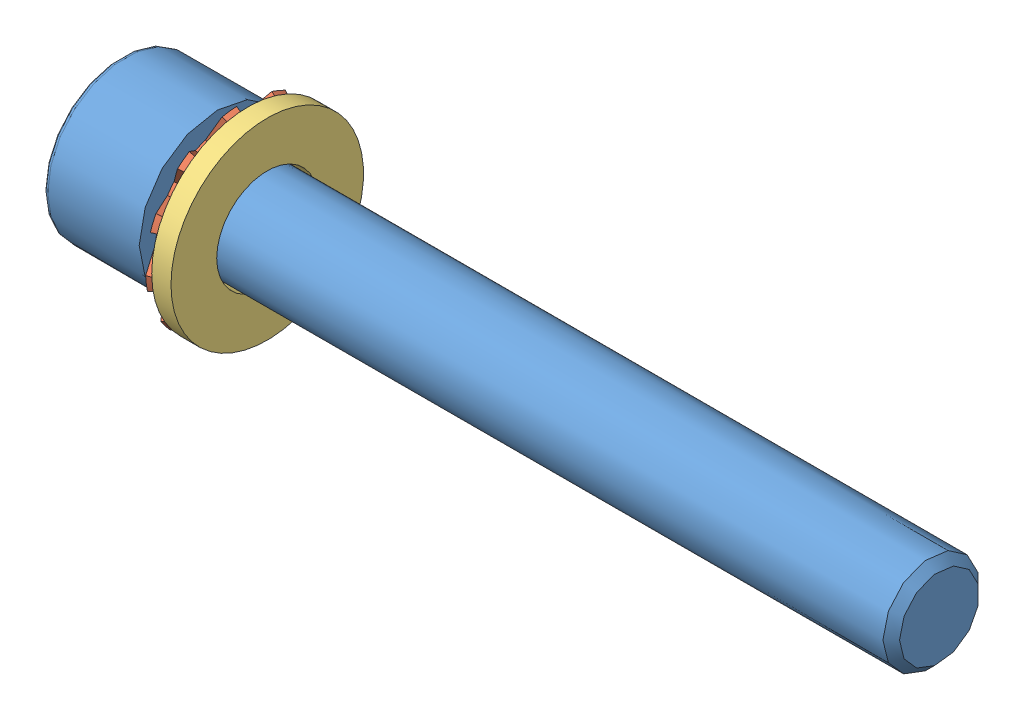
SolidWorks assembly Assemblage1.sldasm, configuration Défaut (file format 3400). Lengths in mm.
Overall size (68 20.54 20.54).
3 component instances, 3 part files, 4 mates.
Components (placement in the parent):
- Vis CHC M8 60-1: Vis CHC M8 60.SLDPRT [ISO 4762 M8 x 60 --- 60C] at origin size (68 13 13)
- Rondelle frein m8-1: Rondelle frein m8.SLDPRT [JIS B 1255 C 8] at (5.4019 0 0) x (-1 0 0) z (0 -0.924225 -0.381849) size (2.54 15.73 15.73)
- Rondelle M8-1: Rondelle M8.SLDPRT [Washer ISO 7089 - 8] at (12.1403 0 0) size (1.6 16 16)
Mates (geometry in assembly coordinates):
- Coaxiale11: concentric aligned: cylinder of ?; cone of ?
- Coïncidente1: coincident aligned: plane of ?; circle of ?
- Coaxiale2: concentric aligned: cylinder of ?; cylinder of ?
- Coïncidente2: coincident anti-aligned: circle of ?; plane of ?
